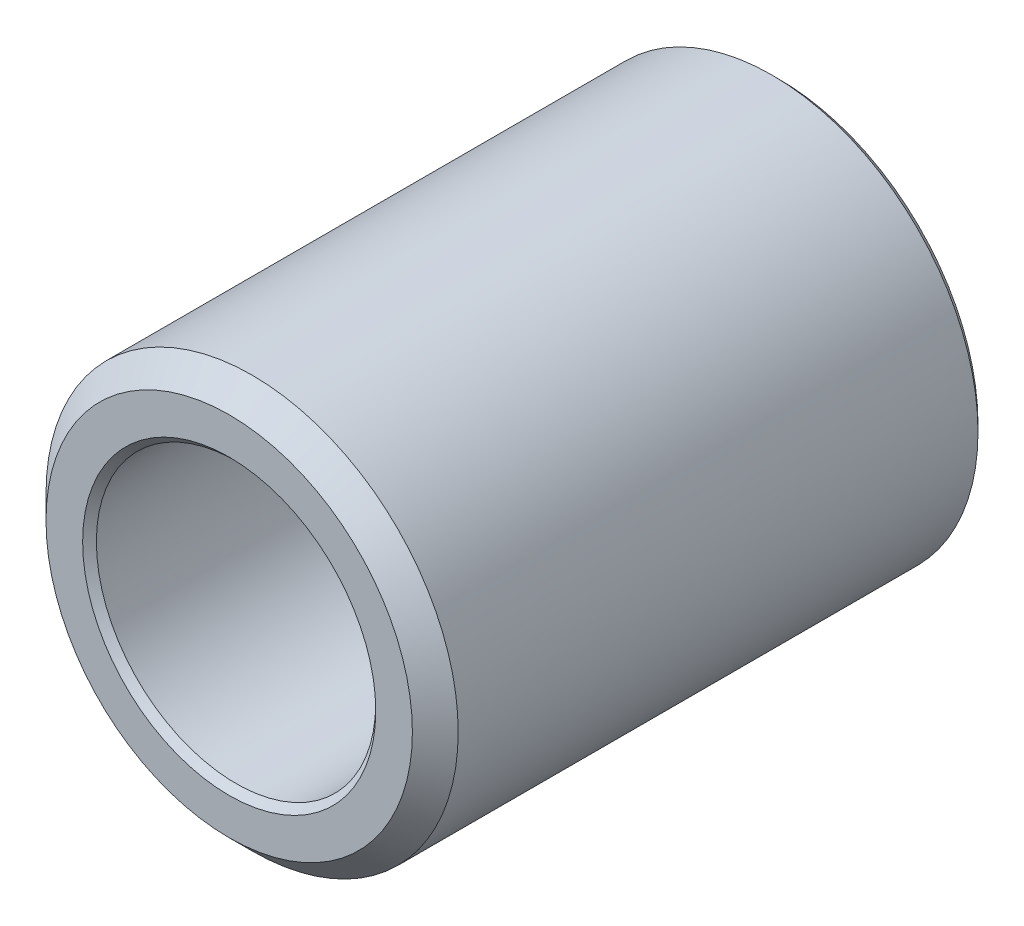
ISO-10303-21;
HEADER;
FILE_DESCRIPTION(('STEP AP214'),'2;1');
FILE_NAME('part.step','',(''),(''),'','','');
FILE_SCHEMA(('AUTOMOTIVE_DESIGN { 1 0 10303 214 1 1 1 1 }'));
ENDSEC;
DATA;
#1=APPLICATION_CONTEXT('core data for automotive mechanical design processes');
#2=APPLICATION_PROTOCOL_DEFINITION('international standard','automotive_design',2000,#1);
#3=PRODUCT_CONTEXT('',#1,'mechanical');
#4=PRODUCT('Part','Part','',(#3));
#5=PRODUCT_RELATED_PRODUCT_CATEGORY('part','',(#4));
#6=PRODUCT_DEFINITION_FORMATION('','',#4);
#7=PRODUCT_DEFINITION_CONTEXT('part definition',#1,'design');
#8=PRODUCT_DEFINITION('design','',#6,#7);
#9=PRODUCT_DEFINITION_SHAPE('','',#8);
#10=(LENGTH_UNIT() NAMED_UNIT(*) SI_UNIT(.MILLI.,.METRE.));
#11=(NAMED_UNIT(*) PLANE_ANGLE_UNIT() SI_UNIT($,.RADIAN.));
#12=(NAMED_UNIT(*) SI_UNIT($,.STERADIAN.) SOLID_ANGLE_UNIT());
#13=UNCERTAINTY_MEASURE_WITH_UNIT(LENGTH_MEASURE(1.E-05),#10,'distance_accuracy_value','');
#14=(GEOMETRIC_REPRESENTATION_CONTEXT(3) GLOBAL_UNCERTAINTY_ASSIGNED_CONTEXT((#13)) GLOBAL_UNIT_ASSIGNED_CONTEXT((#10,
#11,#12)) REPRESENTATION_CONTEXT('',''));
#15=CARTESIAN_POINT('',(0.,0.,0.));
#16=DIRECTION('',(0.,0.,1.));
#17=DIRECTION('',(1.,0.,0.));
#18=AXIS2_PLACEMENT_3D('',#15,#16,#17);
#19=CARTESIAN_POINT('',(0.,0.,12.));
#20=DIRECTION('',(0.,0.,1.));
#21=DIRECTION('',(1.,0.,0.));
#22=AXIS2_PLACEMENT_3D('',#19,#20,#21);
#23=PLANE('',#22);
#24=CARTESIAN_POINT('',(0.,0.,12.));
#25=DIRECTION('',(0.,0.,1.));
#26=DIRECTION('',(1.,0.,0.));
#27=AXIS2_PLACEMENT_3D('',#24,#25,#26);
#28=CIRCLE('',#27,3.20000000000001);
#29=CARTESIAN_POINT('',(3.20000000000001,0.,12.));
#30=VERTEX_POINT('',#29);
#31=EDGE_CURVE('E36',#30,#30,#28,.F.);
#32=ORIENTED_EDGE('',*,*,#31,.T.);
#33=EDGE_LOOP('',(#32));
#34=FACE_BOUND('',#33,.T.);
#35=CARTESIAN_POINT('',(0.,0.,12.));
#36=DIRECTION('',(0.,0.,1.));
#37=DIRECTION('',(1.,0.,0.));
#38=AXIS2_PLACEMENT_3D('',#35,#36,#37);
#39=CIRCLE('',#38,4.);
#40=CARTESIAN_POINT('',(4.,0.,12.));
#41=VERTEX_POINT('',#40);
#42=EDGE_CURVE('E58',#41,#41,#39,.T.);
#43=ORIENTED_EDGE('',*,*,#42,.T.);
#44=EDGE_LOOP('',(#43));
#45=FACE_BOUND('',#44,.T.);
#46=ADVANCED_FACE('F29',(#34,#45),#23,.T.);
#47=CARTESIAN_POINT('',(0.,0.,0.));
#48=DIRECTION('',(0.,0.,1.));
#49=DIRECTION('',(1.,0.,0.));
#50=AXIS2_PLACEMENT_3D('',#47,#48,#49);
#51=PLANE('',#50);
#52=CARTESIAN_POINT('',(0.,0.,0.));
#53=DIRECTION('',(0.,0.,1.));
#54=DIRECTION('',(1.,0.,0.));
#55=AXIS2_PLACEMENT_3D('',#52,#53,#54);
#56=CIRCLE('',#55,3.20000000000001);
#57=CARTESIAN_POINT('',(3.20000000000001,0.,0.));
#58=VERTEX_POINT('',#57);
#59=EDGE_CURVE('E49',#58,#58,#56,.T.);
#60=ORIENTED_EDGE('',*,*,#59,.T.);
#61=EDGE_LOOP('',(#60));
#62=FACE_BOUND('',#61,.T.);
#63=CARTESIAN_POINT('',(0.,0.,0.));
#64=DIRECTION('',(0.,0.,1.));
#65=DIRECTION('',(1.,0.,0.));
#66=AXIS2_PLACEMENT_3D('',#63,#64,#65);
#67=CIRCLE('',#66,4.35);
#68=CARTESIAN_POINT('',(4.35,0.,0.));
#69=VERTEX_POINT('',#68);
#70=EDGE_CURVE('E52',#69,#69,#67,.F.);
#71=ORIENTED_EDGE('',*,*,#70,.T.);
#72=EDGE_LOOP('',(#71));
#73=FACE_BOUND('',#72,.T.);
#74=ADVANCED_FACE('F82',(#62,#73),#51,.F.);
#75=CARTESIAN_POINT('',(0.,0.,12.));
#76=DIRECTION('',(0.,0.,-1.));
#77=DIRECTION('',(-1.,0.,0.));
#78=AXIS2_PLACEMENT_3D('',#75,#76,#77);
#79=CYLINDRICAL_SURFACE('',#78,4.5);
#80=CARTESIAN_POINT('',(0.,0.,0.149999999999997));
#81=DIRECTION('',(0.,0.,1.));
#82=DIRECTION('',(1.,0.,0.));
#83=AXIS2_PLACEMENT_3D('',#80,#81,#82);
#84=CIRCLE('',#83,4.5);
#85=CARTESIAN_POINT('',(4.5,0.,0.149999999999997));
#86=VERTEX_POINT('',#85);
#87=EDGE_CURVE('E10',#86,#86,#84,.T.);
#88=ORIENTED_EDGE('',*,*,#87,.T.);
#89=EDGE_LOOP('',(#88));
#90=FACE_BOUND('',#89,.T.);
#91=CARTESIAN_POINT('',(0.,0.,11.5));
#92=DIRECTION('',(0.,0.,1.));
#93=DIRECTION('',(1.,0.,0.));
#94=AXIS2_PLACEMENT_3D('',#91,#92,#93);
#95=CIRCLE('',#94,4.5);
#96=CARTESIAN_POINT('',(4.5,0.,11.5));
#97=VERTEX_POINT('',#96);
#98=EDGE_CURVE('E55',#97,#97,#95,.F.);
#99=ORIENTED_EDGE('',*,*,#98,.T.);
#100=EDGE_LOOP('',(#99));
#101=FACE_BOUND('',#100,.T.);
#102=ADVANCED_FACE('F76',(#90,#101),#79,.T.);
#103=CARTESIAN_POINT('',(0.,0.,12.));
#104=DIRECTION('',(0.,0.,-1.));
#105=DIRECTION('',(-1.,0.,0.));
#106=AXIS2_PLACEMENT_3D('',#103,#104,#105);
#107=CYLINDRICAL_SURFACE('',#106,3.05);
#108=CARTESIAN_POINT('',(0.,0.,0.150000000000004));
#109=DIRECTION('',(0.,0.,1.));
#110=DIRECTION('',(1.,0.,0.));
#111=AXIS2_PLACEMENT_3D('',#108,#109,#110);
#112=CIRCLE('',#111,3.05);
#113=CARTESIAN_POINT('',(3.05,0.,0.150000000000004));
#114=VERTEX_POINT('',#113);
#115=EDGE_CURVE('E40',#114,#114,#112,.F.);
#116=ORIENTED_EDGE('',*,*,#115,.T.);
#117=EDGE_LOOP('',(#116));
#118=FACE_BOUND('',#117,.T.);
#119=CARTESIAN_POINT('',(0.,0.,11.85));
#120=DIRECTION('',(0.,0.,1.));
#121=DIRECTION('',(1.,0.,0.));
#122=AXIS2_PLACEMENT_3D('',#119,#120,#121);
#123=CIRCLE('',#122,3.05);
#124=CARTESIAN_POINT('',(3.05,0.,11.85));
#125=VERTEX_POINT('',#124);
#126=EDGE_CURVE('E44',#125,#125,#123,.T.);
#127=ORIENTED_EDGE('',*,*,#126,.T.);
#128=EDGE_LOOP('',(#127));
#129=FACE_BOUND('',#128,.T.);
#130=ADVANCED_FACE('F66',(#118,#129),#107,.F.);
#131=CARTESIAN_POINT('',(0.,0.,12.));
#132=DIRECTION('',(0.,0.,-1.));
#133=DIRECTION('',(-1.,0.,0.));
#134=AXIS2_PLACEMENT_3D('',#131,#132,#133);
#135=CONICAL_SURFACE('',#134,4.,0.785398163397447);
#136=ORIENTED_EDGE('',*,*,#98,.F.);
#137=EDGE_LOOP('',(#136));
#138=FACE_BOUND('',#137,.T.);
#139=ORIENTED_EDGE('',*,*,#42,.F.);
#140=EDGE_LOOP('',(#139));
#141=FACE_BOUND('',#140,.T.);
#142=ADVANCED_FACE('F63',(#138,#141),#135,.T.);
#143=CARTESIAN_POINT('',(0.,0.,0.));
#144=DIRECTION('',(0.,0.,-1.));
#145=DIRECTION('',(-1.,0.,0.));
#146=AXIS2_PLACEMENT_3D('',#143,#144,#145);
#147=CONICAL_SURFACE('',#146,3.20000000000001,0.785398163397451);
#148=ORIENTED_EDGE('',*,*,#115,.F.);
#149=EDGE_LOOP('',(#148));
#150=FACE_BOUND('',#149,.T.);
#151=ORIENTED_EDGE('',*,*,#59,.F.);
#152=EDGE_LOOP('',(#151));
#153=FACE_BOUND('',#152,.T.);
#154=ADVANCED_FACE('F65',(#150,#153),#147,.F.);
#155=CARTESIAN_POINT('',(0.,0.,11.85));
#156=DIRECTION('',(0.,0.,1.));
#157=DIRECTION('',(1.,0.,0.));
#158=AXIS2_PLACEMENT_3D('',#155,#156,#157);
#159=CONICAL_SURFACE('',#158,3.05,0.785398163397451);
#160=ORIENTED_EDGE('',*,*,#31,.F.);
#161=EDGE_LOOP('',(#160));
#162=FACE_BOUND('',#161,.T.);
#163=ORIENTED_EDGE('',*,*,#126,.F.);
#164=EDGE_LOOP('',(#163));
#165=FACE_BOUND('',#164,.T.);
#166=ADVANCED_FACE('F73',(#162,#165),#159,.F.);
#167=CARTESIAN_POINT('',(0.,0.,0.149999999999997));
#168=DIRECTION('',(0.,0.,1.));
#169=DIRECTION('',(1.,0.,0.));
#170=AXIS2_PLACEMENT_3D('',#167,#168,#169);
#171=CONICAL_SURFACE('',#170,4.5,0.785398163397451);
#172=ORIENTED_EDGE('',*,*,#70,.F.);
#173=EDGE_LOOP('',(#172));
#174=FACE_BOUND('',#173,.T.);
#175=ORIENTED_EDGE('',*,*,#87,.F.);
#176=EDGE_LOOP('',(#175));
#177=FACE_BOUND('',#176,.T.);
#178=ADVANCED_FACE('F31',(#174,#177),#171,.T.);
#179=CLOSED_SHELL('',(#46,#74,#102,#130,#142,#154,#166,#178));
#180=MANIFOLD_SOLID_BREP('B2',#179);
#181=ADVANCED_BREP_SHAPE_REPRESENTATION('',(#18,#180),#14);
#182=SHAPE_DEFINITION_REPRESENTATION(#9,#181);
ENDSEC;
END-ISO-10303-21;
